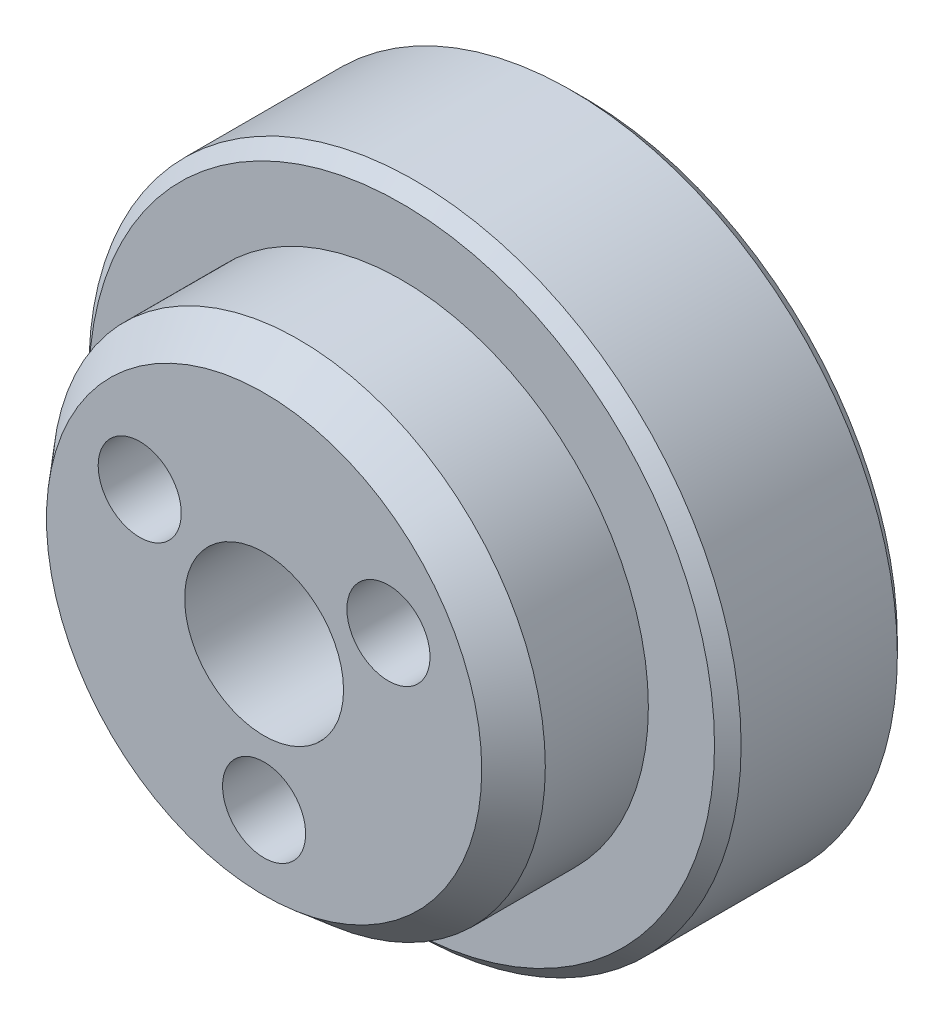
from build123d import *

# Parameters (mm, degrees)
SKETCH1_R         = 12.4587
BLOCK_DEPTH       = 12.2428
SKETCH2_OUTSIDE_W = 34.378
SKETCH2_OUTSIDE_H = 34.378
SKETCH2_OUTSIDE_R = 9.4234
TOP_BLOCK_DEPTH   = 5.2578
CHAMFER2_SIZE     = 1.3208
CHAMFER2_SIZE2    = 1.108282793
SKETCH3_R         = 3.0353
SPRING_HOLE_DEPTH = 10.668
SKETCH4_R         = 1.1684
SKETCH4_R_2       = 1.6002
ALIGN_HOLE_DEPTH  = 3.048
SKETCH5_R         = 1.5875
CYLINDER_DEPTH    = 22.455175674
CIRPATTERN1_COUNT = 3
CHAMFER3_SIZE     = 0.508


with BuildPart() as part:
    # Sketch1 → block (new body)
    with BuildSketch(Plane.XY):
        Circle(SKETCH1_R)
    extrude(amount=BLOCK_DEPTH)

    # Sketch2 outside → top_block (cut)
    with BuildSketch(Plane.XY.offset(12.2428)):
        Rectangle(SKETCH2_OUTSIDE_W, SKETCH2_OUTSIDE_H)
        Circle(SKETCH2_OUTSIDE_R, mode=Mode.SUBTRACT)
    extrude(amount=-TOP_BLOCK_DEPTH, mode=Mode.SUBTRACT)

    # Chamfer2
    chamfer2_edges = [part.edges().sort_by_distance(p)[0] for p in [
        (-9.4234, 0, 12.2428),
    ]]
    chamfer2_side = [part.faces().sort_by_distance(p)[0] for p in [
        (-9.4234, 0, 9.6139),
    ]]
    chamfer(chamfer2_edges, length=CHAMFER2_SIZE, length2=CHAMFER2_SIZE2, reference=chamfer2_side[0])

    # Sketch3 → spring_hole (cut)
    with BuildSketch(Plane.XY.offset(12.2428)):
        Circle(SKETCH3_R)
    extrude(amount=-SPRING_HOLE_DEPTH, mode=Mode.SUBTRACT)

    # Sketch4 → align_hole (cut)
    with BuildSketch(Plane(origin=(0, 0, 0), x_dir=(-1, 0, 0), z_dir=(0, 0, -1))):
        Circle(SKETCH4_R)
        with Locations((0, 7.0104)):
            Circle(SKETCH4_R_2)
    extrude(amount=-ALIGN_HOLE_DEPTH, mode=Mode.SUBTRACT)

    # Sketch5 → cylinder (cut, through all)
    with BuildSketch(Plane(origin=(0, 0, 0), x_dir=(-1, 0, 0), z_dir=(0, 0, -1))):
        with Locations((0, -5.4864)):
            Circle(SKETCH5_R)
    cylinder = extrude(amount=-CYLINDER_DEPTH, mode=Mode.SUBTRACT)

    # CirPattern1: cylinder ×3 about axis
    cirpattern1_axis = Axis((0, 0, 0), (0, 0, 1))
    for i in range(1, CIRPATTERN1_COUNT):
        add(cylinder.rotate(cirpattern1_axis, i * 360 / CIRPATTERN1_COUNT), mode=Mode.SUBTRACT)

    # Chamfer3
    chamfer3_edges = [part.edges().sort_by_distance(p)[0] for p in [
        (-12.4587, 0, 0),
        (-12.4587, 0, 6.985),
    ]]
    chamfer(chamfer3_edges, length=CHAMFER3_SIZE)


solid = part.part
